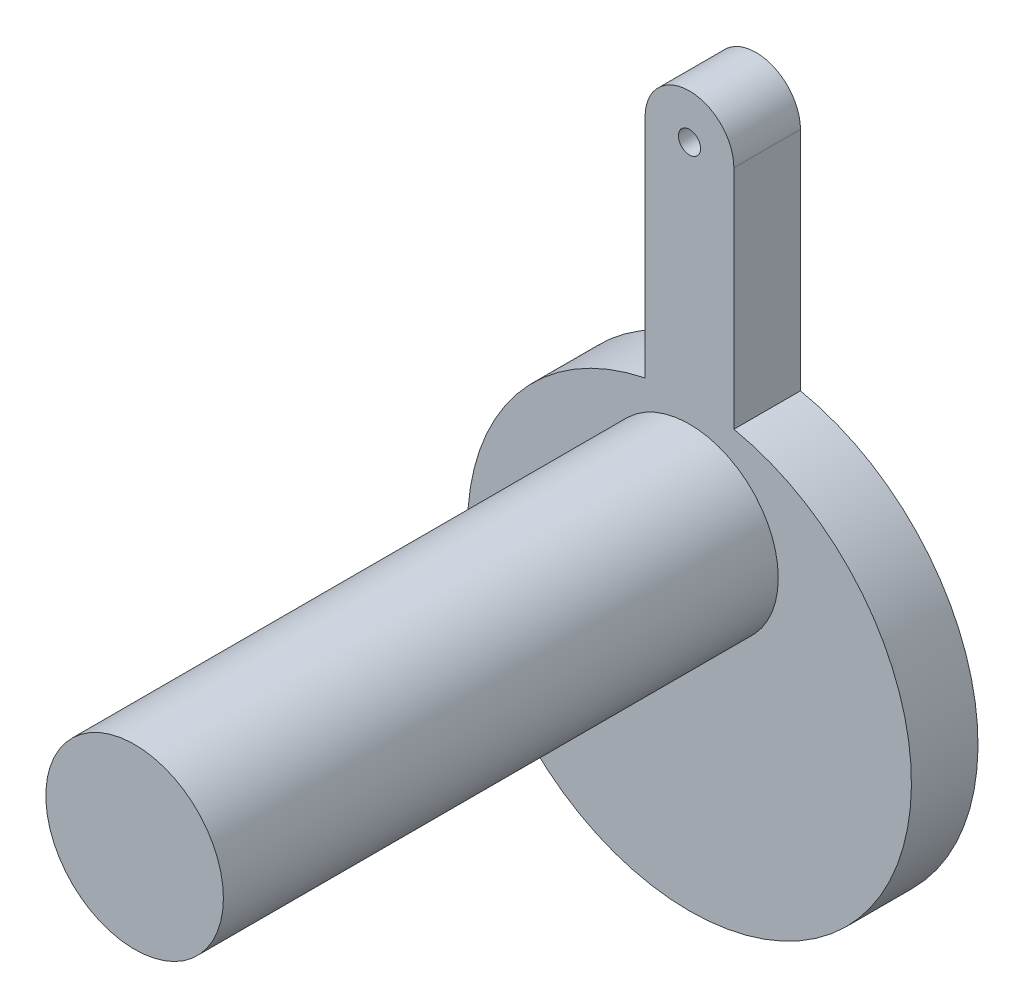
ISO-10303-21;
HEADER;
FILE_DESCRIPTION(('STEP AP214'),'2;1');
FILE_NAME('part.step','',(''),(''),'','','');
FILE_SCHEMA(('AUTOMOTIVE_DESIGN { 1 0 10303 214 1 1 1 1 }'));
ENDSEC;
DATA;
#1=APPLICATION_CONTEXT('core data for automotive mechanical design processes');
#2=APPLICATION_PROTOCOL_DEFINITION('international standard','automotive_design',2000,#1);
#3=PRODUCT_CONTEXT('',#1,'mechanical');
#4=PRODUCT('Part','Part','',(#3));
#5=PRODUCT_RELATED_PRODUCT_CATEGORY('part','',(#4));
#6=PRODUCT_DEFINITION_FORMATION('','',#4);
#7=PRODUCT_DEFINITION_CONTEXT('part definition',#1,'design');
#8=PRODUCT_DEFINITION('design','',#6,#7);
#9=PRODUCT_DEFINITION_SHAPE('','',#8);
#10=(LENGTH_UNIT() NAMED_UNIT(*) SI_UNIT(.MILLI.,.METRE.));
#11=(NAMED_UNIT(*) PLANE_ANGLE_UNIT() SI_UNIT($,.RADIAN.));
#12=(NAMED_UNIT(*) SI_UNIT($,.STERADIAN.) SOLID_ANGLE_UNIT());
#13=UNCERTAINTY_MEASURE_WITH_UNIT(LENGTH_MEASURE(1.E-05),#10,'distance_accuracy_value','');
#14=(GEOMETRIC_REPRESENTATION_CONTEXT(3) GLOBAL_UNCERTAINTY_ASSIGNED_CONTEXT((#13)) GLOBAL_UNIT_ASSIGNED_CONTEXT((#10,
#11,#12)) REPRESENTATION_CONTEXT('',''));
#15=CARTESIAN_POINT('',(0.,0.,0.));
#16=DIRECTION('',(0.,0.,1.));
#17=DIRECTION('',(1.,0.,0.));
#18=AXIS2_PLACEMENT_3D('',#15,#16,#17);
#19=CARTESIAN_POINT('',(0.,55.,30.));
#20=DIRECTION('',(0.,0.,-1.));
#21=DIRECTION('',(-1.,0.,0.));
#22=AXIS2_PLACEMENT_3D('',#19,#20,#21);
#23=CYLINDRICAL_SURFACE('',#22,20.);
#24=CARTESIAN_POINT('',(0.,55.,0.));
#25=DIRECTION('',(0.,0.,1.));
#26=DIRECTION('',(-1.,0.,0.));
#27=AXIS2_PLACEMENT_3D('',#24,#25,#26);
#28=CIRCLE('',#27,20.);
#29=CARTESIAN_POINT('',(20.,55.,0.));
#30=VERTEX_POINT('',#29);
#31=CARTESIAN_POINT('',(-20.,55.,0.));
#32=VERTEX_POINT('',#31);
#33=EDGE_CURVE('E93',#30,#32,#28,.T.);
#34=ORIENTED_EDGE('',*,*,#33,.T.);
#35=DIRECTION('',(0.,0.,-1.));
#36=VECTOR('',#35,1.);
#37=CARTESIAN_POINT('',(-20.,55.,30.));
#38=LINE('',#37,#36);
#39=CARTESIAN_POINT('',(-20.,55.,30.));
#40=VERTEX_POINT('',#39);
#41=EDGE_CURVE('E11',#40,#32,#38,.T.);
#42=ORIENTED_EDGE('',*,*,#41,.F.);
#43=CARTESIAN_POINT('',(0.,55.,30.));
#44=DIRECTION('',(0.,0.,1.));
#45=DIRECTION('',(-1.,0.,0.));
#46=AXIS2_PLACEMENT_3D('',#43,#44,#45);
#47=CIRCLE('',#46,20.);
#48=CARTESIAN_POINT('',(20.,55.,30.));
#49=VERTEX_POINT('',#48);
#50=EDGE_CURVE('E81',#49,#40,#47,.T.);
#51=ORIENTED_EDGE('',*,*,#50,.F.);
#52=DIRECTION('',(0.,0.,-1.));
#53=VECTOR('',#52,1.);
#54=CARTESIAN_POINT('',(20.,55.,30.));
#55=LINE('',#54,#53);
#56=EDGE_CURVE('E89',#49,#30,#55,.T.);
#57=ORIENTED_EDGE('',*,*,#56,.T.);
#58=EDGE_LOOP('',(#34,#42,#51,#57));
#59=FACE_BOUND('',#58,.T.);
#60=ADVANCED_FACE('F30',(#59),#23,.T.);
#61=CARTESIAN_POINT('',(-20.,55.,30.));
#62=DIRECTION('',(1.,0.,0.));
#63=DIRECTION('',(0.,1.,0.));
#64=AXIS2_PLACEMENT_3D('',#61,#62,#63);
#65=PLANE('',#64);
#66=DIRECTION('',(0.,-1.,0.));
#67=VECTOR('',#66,1.);
#68=CARTESIAN_POINT('',(-20.,55.,0.));
#69=LINE('',#68,#67);
#70=CARTESIAN_POINT('',(-20.,-47.0204102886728,0.));
#71=VERTEX_POINT('',#70);
#72=EDGE_CURVE('E85',#32,#71,#69,.T.);
#73=ORIENTED_EDGE('',*,*,#72,.T.);
#74=DIRECTION('',(0.,0.,-1.));
#75=VECTOR('',#74,1.);
#76=CARTESIAN_POINT('',(-20.,-47.0204102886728,30.));
#77=LINE('',#76,#75);
#78=CARTESIAN_POINT('',(-20.,-47.0204102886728,30.));
#79=VERTEX_POINT('',#78);
#80=EDGE_CURVE('E38',#79,#71,#77,.T.);
#81=ORIENTED_EDGE('',*,*,#80,.F.);
#82=DIRECTION('',(0.,-1.,0.));
#83=VECTOR('',#82,1.);
#84=CARTESIAN_POINT('',(-20.,55.,30.));
#85=LINE('',#84,#83);
#86=EDGE_CURVE('E76',#40,#79,#85,.T.);
#87=ORIENTED_EDGE('',*,*,#86,.F.);
#88=ORIENTED_EDGE('',*,*,#41,.T.);
#89=EDGE_LOOP('',(#73,#81,#87,#88));
#90=FACE_BOUND('',#89,.T.);
#91=ADVANCED_FACE('F84',(#90),#65,.F.);
#92=CARTESIAN_POINT('',(0.,-145.,30.));
#93=DIRECTION('',(0.,0.,-1.));
#94=DIRECTION('',(-1.,0.,0.));
#95=AXIS2_PLACEMENT_3D('',#92,#93,#94);
#96=CYLINDRICAL_SURFACE('',#95,100.);
#97=CARTESIAN_POINT('',(0.,-145.,0.));
#98=DIRECTION('',(0.,0.,1.));
#99=DIRECTION('',(1.,0.,0.));
#100=AXIS2_PLACEMENT_3D('',#97,#98,#99);
#101=CIRCLE('',#100,100.);
#102=CARTESIAN_POINT('',(20.,-47.0204102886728,0.));
#103=VERTEX_POINT('',#102);
#104=EDGE_CURVE('E63',#71,#103,#101,.T.);
#105=ORIENTED_EDGE('',*,*,#104,.T.);
#106=DIRECTION('',(0.,0.,-1.));
#107=VECTOR('',#106,1.);
#108=CARTESIAN_POINT('',(20.,-47.0204102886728,30.));
#109=LINE('',#108,#107);
#110=CARTESIAN_POINT('',(20.,-47.0204102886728,30.));
#111=VERTEX_POINT('',#110);
#112=EDGE_CURVE('E86',#111,#103,#109,.T.);
#113=ORIENTED_EDGE('',*,*,#112,.F.);
#114=CARTESIAN_POINT('',(0.,-145.,30.));
#115=DIRECTION('',(0.,0.,1.));
#116=DIRECTION('',(1.,0.,0.));
#117=AXIS2_PLACEMENT_3D('',#114,#115,#116);
#118=CIRCLE('',#117,100.);
#119=EDGE_CURVE('E79',#79,#111,#118,.T.);
#120=ORIENTED_EDGE('',*,*,#119,.F.);
#121=ORIENTED_EDGE('',*,*,#80,.T.);
#122=EDGE_LOOP('',(#105,#113,#120,#121));
#123=FACE_BOUND('',#122,.T.);
#124=ADVANCED_FACE('F87',(#123),#96,.T.);
#125=CARTESIAN_POINT('',(20.,55.,30.));
#126=DIRECTION('',(-1.,0.,0.));
#127=DIRECTION('',(0.,-1.,0.));
#128=AXIS2_PLACEMENT_3D('',#125,#126,#127);
#129=PLANE('',#128);
#130=DIRECTION('',(0.,1.,0.));
#131=VECTOR('',#130,1.);
#132=CARTESIAN_POINT('',(20.,55.,0.));
#133=LINE('',#132,#131);
#134=EDGE_CURVE('E69',#103,#30,#133,.T.);
#135=ORIENTED_EDGE('',*,*,#134,.T.);
#136=ORIENTED_EDGE('',*,*,#56,.F.);
#137=DIRECTION('',(0.,1.,0.));
#138=VECTOR('',#137,1.);
#139=CARTESIAN_POINT('',(20.,55.,30.));
#140=LINE('',#139,#138);
#141=EDGE_CURVE('E46',#111,#49,#140,.T.);
#142=ORIENTED_EDGE('',*,*,#141,.F.);
#143=ORIENTED_EDGE('',*,*,#112,.T.);
#144=EDGE_LOOP('',(#135,#136,#142,#143));
#145=FACE_BOUND('',#144,.T.);
#146=ADVANCED_FACE('F101',(#145),#129,.F.);
#147=CARTESIAN_POINT('',(0.,55.,30.));
#148=DIRECTION('',(0.,0.,-1.));
#149=DIRECTION('',(-1.,0.,0.));
#150=AXIS2_PLACEMENT_3D('',#147,#148,#149);
#151=PLANE('',#150);
#152=CARTESIAN_POINT('',(0.,-95.,30.));
#153=DIRECTION('',(0.,0.,1.));
#154=DIRECTION('',(1.,0.,0.));
#155=AXIS2_PLACEMENT_3D('',#152,#153,#154);
#156=CIRCLE('',#155,40.);
#157=CARTESIAN_POINT('',(40.,-95.,30.));
#158=VERTEX_POINT('',#157);
#159=EDGE_CURVE('E110',#158,#158,#156,.T.);
#160=ORIENTED_EDGE('',*,*,#159,.F.);
#161=EDGE_LOOP('',(#160));
#162=FACE_BOUND('',#161,.T.);
#163=CARTESIAN_POINT('',(0.,55.,30.));
#164=DIRECTION('',(0.,0.,1.));
#165=DIRECTION('',(1.,0.,0.));
#166=AXIS2_PLACEMENT_3D('',#163,#164,#165);
#167=CIRCLE('',#166,5.);
#168=CARTESIAN_POINT('',(5.,55.,30.));
#169=VERTEX_POINT('',#168);
#170=EDGE_CURVE('E107',#169,#169,#167,.T.);
#171=ORIENTED_EDGE('',*,*,#170,.F.);
#172=EDGE_LOOP('',(#171));
#173=FACE_BOUND('',#172,.T.);
#174=ORIENTED_EDGE('',*,*,#50,.T.);
#175=ORIENTED_EDGE('',*,*,#86,.T.);
#176=ORIENTED_EDGE('',*,*,#119,.T.);
#177=ORIENTED_EDGE('',*,*,#141,.T.);
#178=EDGE_LOOP('',(#174,#175,#176,#177));
#179=FACE_BOUND('',#178,.T.);
#180=ADVANCED_FACE('F77',(#162,#173,#179),#151,.F.);
#181=CARTESIAN_POINT('',(0.,55.,0.));
#182=DIRECTION('',(0.,0.,-1.));
#183=DIRECTION('',(-1.,0.,0.));
#184=AXIS2_PLACEMENT_3D('',#181,#182,#183);
#185=PLANE('',#184);
#186=CARTESIAN_POINT('',(0.,55.,0.));
#187=DIRECTION('',(0.,0.,1.));
#188=DIRECTION('',(1.,0.,0.));
#189=AXIS2_PLACEMENT_3D('',#186,#187,#188);
#190=CIRCLE('',#189,5.);
#191=CARTESIAN_POINT('',(5.,55.,0.));
#192=VERTEX_POINT('',#191);
#193=EDGE_CURVE('E96',#192,#192,#190,.T.);
#194=ORIENTED_EDGE('',*,*,#193,.T.);
#195=EDGE_LOOP('',(#194));
#196=FACE_BOUND('',#195,.T.);
#197=ORIENTED_EDGE('',*,*,#33,.F.);
#198=ORIENTED_EDGE('',*,*,#134,.F.);
#199=ORIENTED_EDGE('',*,*,#104,.F.);
#200=ORIENTED_EDGE('',*,*,#72,.F.);
#201=EDGE_LOOP('',(#197,#198,#199,#200));
#202=FACE_BOUND('',#201,.T.);
#203=ADVANCED_FACE('F104',(#196,#202),#185,.T.);
#204=CARTESIAN_POINT('',(0.,55.,0.));
#205=DIRECTION('',(0.,0.,1.));
#206=DIRECTION('',(1.,0.,0.));
#207=AXIS2_PLACEMENT_3D('',#204,#205,#206);
#208=CYLINDRICAL_SURFACE('',#207,5.);
#209=ORIENTED_EDGE('',*,*,#193,.F.);
#210=EDGE_LOOP('',(#209));
#211=FACE_BOUND('',#210,.T.);
#212=ORIENTED_EDGE('',*,*,#170,.T.);
#213=EDGE_LOOP('',(#212));
#214=FACE_BOUND('',#213,.T.);
#215=ADVANCED_FACE('F124',(#211,#214),#208,.F.);
#216=CARTESIAN_POINT('',(0.,-95.,0.));
#217=DIRECTION('',(0.,0.,1.));
#218=DIRECTION('',(1.,0.,0.));
#219=AXIS2_PLACEMENT_3D('',#216,#217,#218);
#220=CYLINDRICAL_SURFACE('',#219,40.);
#221=CARTESIAN_POINT('',(0.,-95.,280.));
#222=DIRECTION('',(0.,0.,1.));
#223=DIRECTION('',(1.,0.,0.));
#224=AXIS2_PLACEMENT_3D('',#221,#222,#223);
#225=CIRCLE('',#224,40.);
#226=CARTESIAN_POINT('',(40.,-95.,280.));
#227=VERTEX_POINT('',#226);
#228=EDGE_CURVE('E115',#227,#227,#225,.T.);
#229=ORIENTED_EDGE('',*,*,#228,.F.);
#230=EDGE_LOOP('',(#229));
#231=FACE_BOUND('',#230,.T.);
#232=ORIENTED_EDGE('',*,*,#159,.T.);
#233=EDGE_LOOP('',(#232));
#234=FACE_BOUND('',#233,.T.);
#235=ADVANCED_FACE('F121',(#231,#234),#220,.T.);
#236=CARTESIAN_POINT('',(0.,-95.,280.));
#237=DIRECTION('',(0.,0.,1.));
#238=DIRECTION('',(1.,0.,0.));
#239=AXIS2_PLACEMENT_3D('',#236,#237,#238);
#240=PLANE('',#239);
#241=ORIENTED_EDGE('',*,*,#228,.T.);
#242=EDGE_LOOP('',(#241));
#243=FACE_BOUND('',#242,.T.);
#244=ADVANCED_FACE('F119',(#243),#240,.T.);
#245=CLOSED_SHELL('',(#60,#91,#124,#146,#180,#203,#215,#235,#244));
#246=MANIFOLD_SOLID_BREP('B2',#245);
#247=ADVANCED_BREP_SHAPE_REPRESENTATION('',(#18,#246),#14);
#248=SHAPE_DEFINITION_REPRESENTATION(#9,#247);
ENDSEC;
END-ISO-10303-21;
